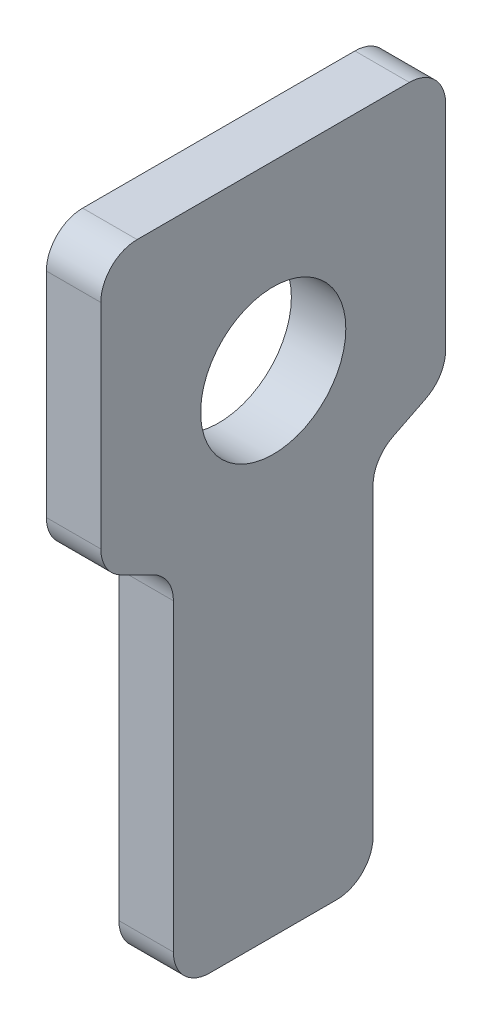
ISO-10303-21;
HEADER;
FILE_DESCRIPTION(('STEP AP214'),'2;1');
FILE_NAME('part.step','',(''),(''),'','','');
FILE_SCHEMA(('AUTOMOTIVE_DESIGN { 1 0 10303 214 1 1 1 1 }'));
ENDSEC;
DATA;
#1=APPLICATION_CONTEXT('core data for automotive mechanical design processes');
#2=APPLICATION_PROTOCOL_DEFINITION('international standard','automotive_design',2000,#1);
#3=PRODUCT_CONTEXT('',#1,'mechanical');
#4=PRODUCT('Part','Part','',(#3));
#5=PRODUCT_RELATED_PRODUCT_CATEGORY('part','',(#4));
#6=PRODUCT_DEFINITION_FORMATION('','',#4);
#7=PRODUCT_DEFINITION_CONTEXT('part definition',#1,'design');
#8=PRODUCT_DEFINITION('design','',#6,#7);
#9=PRODUCT_DEFINITION_SHAPE('','',#8);
#10=(LENGTH_UNIT() NAMED_UNIT(*) SI_UNIT(.MILLI.,.METRE.));
#11=(NAMED_UNIT(*) PLANE_ANGLE_UNIT() SI_UNIT($,.RADIAN.));
#12=(NAMED_UNIT(*) SI_UNIT($,.STERADIAN.) SOLID_ANGLE_UNIT());
#13=UNCERTAINTY_MEASURE_WITH_UNIT(LENGTH_MEASURE(1.E-05),#10,'distance_accuracy_value','');
#14=(GEOMETRIC_REPRESENTATION_CONTEXT(3) GLOBAL_UNCERTAINTY_ASSIGNED_CONTEXT((#13)) GLOBAL_UNIT_ASSIGNED_CONTEXT((#10,
#11,#12)) REPRESENTATION_CONTEXT('',''));
#15=CARTESIAN_POINT('',(0.,0.,0.));
#16=DIRECTION('',(0.,0.,1.));
#17=DIRECTION('',(1.,0.,0.));
#18=AXIS2_PLACEMENT_3D('',#15,#16,#17);
#19=CARTESIAN_POINT('',(3.,10.,-9.5));
#20=DIRECTION('',(-1.,0.,0.));
#21=DIRECTION('',(0.,0.,1.));
#22=AXIS2_PLACEMENT_3D('',#19,#20,#21);
#23=PLANE('',#22);
#24=DIRECTION('',(0.,-1.,0.));
#25=VECTOR('',#24,1.);
#26=CARTESIAN_POINT('',(3.,10.,9.5));
#27=LINE('',#26,#25);
#28=CARTESIAN_POINT('',(3.,8.,9.5));
#29=VERTEX_POINT('',#28);
#30=CARTESIAN_POINT('',(3.,-3.76393202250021,9.5));
#31=VERTEX_POINT('',#30);
#32=EDGE_CURVE('E269',#29,#31,#27,.T.);
#33=ORIENTED_EDGE('',*,*,#32,.T.);
#34=CARTESIAN_POINT('',(3.,-3.76393202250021,7.5));
#35=DIRECTION('',(-1.,0.,0.));
#36=DIRECTION('',(0.,0.,1.));
#37=AXIS2_PLACEMENT_3D('',#34,#35,#36);
#38=CIRCLE('',#37,2.);
#39=CARTESIAN_POINT('',(3.,-5.55278640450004,8.39442719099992));
#40=VERTEX_POINT('',#39);
#41=EDGE_CURVE('E222',#31,#40,#38,.F.);
#42=ORIENTED_EDGE('',*,*,#41,.T.);
#43=DIRECTION('',(0.,-0.447213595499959,-0.894427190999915));
#44=VECTOR('',#43,1.);
#45=CARTESIAN_POINT('',(3.,-5.,9.5));
#46=LINE('',#45,#44);
#47=CARTESIAN_POINT('',(3.,-6.44721359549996,6.60557280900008));
#48=VERTEX_POINT('',#47);
#49=EDGE_CURVE('E260',#40,#48,#46,.T.);
#50=ORIENTED_EDGE('',*,*,#49,.T.);
#51=CARTESIAN_POINT('',(3.,-8.2360679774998,7.5));
#52=DIRECTION('',(-1.,0.,0.));
#53=DIRECTION('',(0.,0.,1.));
#54=AXIS2_PLACEMENT_3D('',#51,#52,#53);
#55=CIRCLE('',#54,2.);
#56=CARTESIAN_POINT('',(3.,-8.2360679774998,5.5));
#57=VERTEX_POINT('',#56);
#58=EDGE_CURVE('E11',#48,#57,#55,.T.);
#59=ORIENTED_EDGE('',*,*,#58,.T.);
#60=DIRECTION('',(0.,-1.,0.));
#61=VECTOR('',#60,1.);
#62=CARTESIAN_POINT('',(3.,-7.00000000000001,5.5));
#63=LINE('',#62,#61);
#64=CARTESIAN_POINT('',(3.,-25.,5.49999999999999));
#65=VERTEX_POINT('',#64);
#66=EDGE_CURVE('E258',#57,#65,#63,.T.);
#67=ORIENTED_EDGE('',*,*,#66,.T.);
#68=CARTESIAN_POINT('',(3.,-25.,3.49999999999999));
#69=DIRECTION('',(-1.,0.,0.));
#70=DIRECTION('',(0.,0.,1.));
#71=AXIS2_PLACEMENT_3D('',#68,#69,#70);
#72=CIRCLE('',#71,2.);
#73=CARTESIAN_POINT('',(3.,-27.,3.49999999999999));
#74=VERTEX_POINT('',#73);
#75=EDGE_CURVE('E217',#65,#74,#72,.F.);
#76=ORIENTED_EDGE('',*,*,#75,.T.);
#77=DIRECTION('',(0.,0.,-1.));
#78=VECTOR('',#77,1.);
#79=CARTESIAN_POINT('',(3.,-27.,5.49999999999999));
#80=LINE('',#79,#78);
#81=CARTESIAN_POINT('',(3.,-27.,-3.50000000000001));
#82=VERTEX_POINT('',#81);
#83=EDGE_CURVE('E264',#74,#82,#80,.T.);
#84=ORIENTED_EDGE('',*,*,#83,.T.);
#85=CARTESIAN_POINT('',(3.,-25.,-3.50000000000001));
#86=DIRECTION('',(-1.,0.,0.));
#87=DIRECTION('',(0.,0.,1.));
#88=AXIS2_PLACEMENT_3D('',#85,#86,#87);
#89=CIRCLE('',#88,2.);
#90=CARTESIAN_POINT('',(3.,-25.,-5.50000000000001));
#91=VERTEX_POINT('',#90);
#92=EDGE_CURVE('E219',#82,#91,#89,.F.);
#93=ORIENTED_EDGE('',*,*,#92,.T.);
#94=DIRECTION('',(0.,1.,0.));
#95=VECTOR('',#94,1.);
#96=CARTESIAN_POINT('',(3.,-7.,-5.5));
#97=LINE('',#96,#95);
#98=CARTESIAN_POINT('',(3.,-8.23606797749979,-5.5));
#99=VERTEX_POINT('',#98);
#100=EDGE_CURVE('E267',#91,#99,#97,.T.);
#101=ORIENTED_EDGE('',*,*,#100,.T.);
#102=CARTESIAN_POINT('',(3.,-8.23606797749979,-7.5));
#103=DIRECTION('',(-1.,0.,0.));
#104=DIRECTION('',(0.,0.,1.));
#105=AXIS2_PLACEMENT_3D('',#102,#103,#104);
#106=CIRCLE('',#105,2.);
#107=CARTESIAN_POINT('',(3.,-6.44721359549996,-6.60557280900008));
#108=VERTEX_POINT('',#107);
#109=EDGE_CURVE('E155',#99,#108,#106,.T.);
#110=ORIENTED_EDGE('',*,*,#109,.T.);
#111=DIRECTION('',(0.,0.447213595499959,-0.894427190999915));
#112=VECTOR('',#111,1.);
#113=CARTESIAN_POINT('',(3.,-5.,-9.50000000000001));
#114=LINE('',#113,#112);
#115=CARTESIAN_POINT('',(3.,-5.55278640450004,-8.39442719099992));
#116=VERTEX_POINT('',#115);
#117=EDGE_CURVE('E164',#108,#116,#114,.T.);
#118=ORIENTED_EDGE('',*,*,#117,.T.);
#119=CARTESIAN_POINT('',(3.,-3.76393202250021,-7.50000000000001));
#120=DIRECTION('',(-1.,0.,0.));
#121=DIRECTION('',(0.,0.,1.));
#122=AXIS2_PLACEMENT_3D('',#119,#120,#121);
#123=CIRCLE('',#122,2.);
#124=CARTESIAN_POINT('',(3.,-3.76393202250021,-9.50000000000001));
#125=VERTEX_POINT('',#124);
#126=EDGE_CURVE('E53',#116,#125,#123,.F.);
#127=ORIENTED_EDGE('',*,*,#126,.T.);
#128=DIRECTION('',(0.,1.,0.));
#129=VECTOR('',#128,1.);
#130=CARTESIAN_POINT('',(3.,10.,-9.5));
#131=LINE('',#130,#129);
#132=CARTESIAN_POINT('',(3.,8.,-9.5));
#133=VERTEX_POINT('',#132);
#134=EDGE_CURVE('E182',#125,#133,#131,.T.);
#135=ORIENTED_EDGE('',*,*,#134,.T.);
#136=CARTESIAN_POINT('',(3.,8.,-7.5));
#137=DIRECTION('',(-1.,0.,0.));
#138=DIRECTION('',(0.,0.,1.));
#139=AXIS2_PLACEMENT_3D('',#136,#137,#138);
#140=CIRCLE('',#139,2.);
#141=CARTESIAN_POINT('',(3.,10.,-7.5));
#142=VERTEX_POINT('',#141);
#143=EDGE_CURVE('E215',#133,#142,#140,.F.);
#144=ORIENTED_EDGE('',*,*,#143,.T.);
#145=DIRECTION('',(0.,0.,1.));
#146=VECTOR('',#145,1.);
#147=CARTESIAN_POINT('',(3.,10.,9.5));
#148=LINE('',#147,#146);
#149=CARTESIAN_POINT('',(3.,10.,7.5));
#150=VERTEX_POINT('',#149);
#151=EDGE_CURVE('E176',#142,#150,#148,.T.);
#152=ORIENTED_EDGE('',*,*,#151,.T.);
#153=CARTESIAN_POINT('',(3.,8.,7.5));
#154=DIRECTION('',(-1.,0.,0.));
#155=DIRECTION('',(0.,0.,1.));
#156=AXIS2_PLACEMENT_3D('',#153,#154,#155);
#157=CIRCLE('',#156,2.);
#158=EDGE_CURVE('E213',#150,#29,#157,.F.);
#159=ORIENTED_EDGE('',*,*,#158,.T.);
#160=EDGE_LOOP('',(#33,#42,#50,#59,#67,#76,#84,#93,#101,#110,#118,#127,#135,#144,#152,#159));
#161=FACE_BOUND('',#160,.T.);
#162=CARTESIAN_POINT('',(3.,0.,0.));
#163=DIRECTION('',(1.,0.,0.));
#164=DIRECTION('',(0.,0.,-1.));
#165=AXIS2_PLACEMENT_3D('',#162,#163,#164);
#166=CIRCLE('',#165,4.);
#167=CARTESIAN_POINT('',(3.,0.,-4.));
#168=VERTEX_POINT('',#167);
#169=EDGE_CURVE('E280',#168,#168,#166,.T.);
#170=ORIENTED_EDGE('',*,*,#169,.F.);
#171=EDGE_LOOP('',(#170));
#172=FACE_BOUND('',#171,.T.);
#173=ADVANCED_FACE('F31',(#161,#172),#23,.F.);
#174=CARTESIAN_POINT('',(0.,10.,-9.5));
#175=DIRECTION('',(-1.,0.,0.));
#176=DIRECTION('',(0.,0.,1.));
#177=AXIS2_PLACEMENT_3D('',#174,#175,#176);
#178=PLANE('',#177);
#179=DIRECTION('',(0.,-0.447213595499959,-0.894427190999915));
#180=VECTOR('',#179,1.);
#181=CARTESIAN_POINT('',(0.,-5.,9.5));
#182=LINE('',#181,#180);
#183=CARTESIAN_POINT('',(0.,-5.55278640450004,8.39442719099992));
#184=VERTEX_POINT('',#183);
#185=CARTESIAN_POINT('',(0.,-6.44721359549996,6.60557280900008));
#186=VERTEX_POINT('',#185);
#187=EDGE_CURVE('E239',#184,#186,#182,.T.);
#188=ORIENTED_EDGE('',*,*,#187,.F.);
#189=CARTESIAN_POINT('',(0.,-3.76393202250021,7.5));
#190=DIRECTION('',(-1.,0.,0.));
#191=DIRECTION('',(0.,0.,1.));
#192=AXIS2_PLACEMENT_3D('',#189,#190,#191);
#193=CIRCLE('',#192,2.);
#194=CARTESIAN_POINT('',(0.,-3.76393202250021,9.5));
#195=VERTEX_POINT('',#194);
#196=EDGE_CURVE('E206',#184,#195,#193,.T.);
#197=ORIENTED_EDGE('',*,*,#196,.T.);
#198=DIRECTION('',(0.,-1.,0.));
#199=VECTOR('',#198,1.);
#200=CARTESIAN_POINT('',(0.,10.,9.5));
#201=LINE('',#200,#199);
#202=CARTESIAN_POINT('',(0.,8.,9.5));
#203=VERTEX_POINT('',#202);
#204=EDGE_CURVE('E250',#203,#195,#201,.T.);
#205=ORIENTED_EDGE('',*,*,#204,.F.);
#206=CARTESIAN_POINT('',(0.,8.,7.5));
#207=DIRECTION('',(-1.,0.,0.));
#208=DIRECTION('',(0.,0.,1.));
#209=AXIS2_PLACEMENT_3D('',#206,#207,#208);
#210=CIRCLE('',#209,2.);
#211=CARTESIAN_POINT('',(0.,10.,7.5));
#212=VERTEX_POINT('',#211);
#213=EDGE_CURVE('E197',#203,#212,#210,.T.);
#214=ORIENTED_EDGE('',*,*,#213,.T.);
#215=DIRECTION('',(0.,0.,1.));
#216=VECTOR('',#215,1.);
#217=CARTESIAN_POINT('',(0.,10.,9.5));
#218=LINE('',#217,#216);
#219=CARTESIAN_POINT('',(0.,10.,-7.5));
#220=VERTEX_POINT('',#219);
#221=EDGE_CURVE('E277',#220,#212,#218,.T.);
#222=ORIENTED_EDGE('',*,*,#221,.F.);
#223=CARTESIAN_POINT('',(0.,8.,-7.5));
#224=DIRECTION('',(-1.,0.,0.));
#225=DIRECTION('',(0.,0.,1.));
#226=AXIS2_PLACEMENT_3D('',#223,#224,#225);
#227=CIRCLE('',#226,2.);
#228=CARTESIAN_POINT('',(0.,8.,-9.5));
#229=VERTEX_POINT('',#228);
#230=EDGE_CURVE('E199',#220,#229,#227,.T.);
#231=ORIENTED_EDGE('',*,*,#230,.T.);
#232=DIRECTION('',(0.,1.,0.));
#233=VECTOR('',#232,1.);
#234=CARTESIAN_POINT('',(0.,10.,-9.5));
#235=LINE('',#234,#233);
#236=CARTESIAN_POINT('',(0.,-3.76393202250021,-9.50000000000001));
#237=VERTEX_POINT('',#236);
#238=EDGE_CURVE('E173',#237,#229,#235,.T.);
#239=ORIENTED_EDGE('',*,*,#238,.F.);
#240=CARTESIAN_POINT('',(0.,-3.76393202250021,-7.50000000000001));
#241=DIRECTION('',(-1.,0.,0.));
#242=DIRECTION('',(0.,0.,1.));
#243=AXIS2_PLACEMENT_3D('',#240,#241,#242);
#244=CIRCLE('',#243,2.);
#245=CARTESIAN_POINT('',(0.,-5.55278640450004,-8.39442719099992));
#246=VERTEX_POINT('',#245);
#247=EDGE_CURVE('E172',#237,#246,#244,.T.);
#248=ORIENTED_EDGE('',*,*,#247,.T.);
#249=DIRECTION('',(0.,0.447213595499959,-0.894427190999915));
#250=VECTOR('',#249,1.);
#251=CARTESIAN_POINT('',(0.,-5.,-9.50000000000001));
#252=LINE('',#251,#250);
#253=CARTESIAN_POINT('',(0.,-6.44721359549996,-6.60557280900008));
#254=VERTEX_POINT('',#253);
#255=EDGE_CURVE('E162',#254,#246,#252,.T.);
#256=ORIENTED_EDGE('',*,*,#255,.F.);
#257=CARTESIAN_POINT('',(0.,-8.23606797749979,-7.5));
#258=DIRECTION('',(-1.,0.,0.));
#259=DIRECTION('',(0.,0.,1.));
#260=AXIS2_PLACEMENT_3D('',#257,#258,#259);
#261=CIRCLE('',#260,2.);
#262=CARTESIAN_POINT('',(0.,-8.23606797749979,-5.5));
#263=VERTEX_POINT('',#262);
#264=EDGE_CURVE('E145',#254,#263,#261,.F.);
#265=ORIENTED_EDGE('',*,*,#264,.T.);
#266=DIRECTION('',(0.,1.,0.));
#267=VECTOR('',#266,1.);
#268=CARTESIAN_POINT('',(0.,-7.,-5.5));
#269=LINE('',#268,#267);
#270=CARTESIAN_POINT('',(0.,-25.,-5.50000000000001));
#271=VERTEX_POINT('',#270);
#272=EDGE_CURVE('E174',#271,#263,#269,.T.);
#273=ORIENTED_EDGE('',*,*,#272,.F.);
#274=CARTESIAN_POINT('',(0.,-25.,-3.50000000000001));
#275=DIRECTION('',(-1.,0.,0.));
#276=DIRECTION('',(0.,0.,1.));
#277=AXIS2_PLACEMENT_3D('',#274,#275,#276);
#278=CIRCLE('',#277,2.);
#279=CARTESIAN_POINT('',(0.,-27.,-3.50000000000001));
#280=VERTEX_POINT('',#279);
#281=EDGE_CURVE('E203',#271,#280,#278,.T.);
#282=ORIENTED_EDGE('',*,*,#281,.T.);
#283=DIRECTION('',(0.,0.,-1.));
#284=VECTOR('',#283,1.);
#285=CARTESIAN_POINT('',(0.,-27.,5.49999999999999));
#286=LINE('',#285,#284);
#287=CARTESIAN_POINT('',(0.,-27.,3.49999999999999));
#288=VERTEX_POINT('',#287);
#289=EDGE_CURVE('E178',#288,#280,#286,.T.);
#290=ORIENTED_EDGE('',*,*,#289,.F.);
#291=CARTESIAN_POINT('',(0.,-25.,3.49999999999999));
#292=DIRECTION('',(-1.,0.,0.));
#293=DIRECTION('',(0.,0.,1.));
#294=AXIS2_PLACEMENT_3D('',#291,#292,#293);
#295=CIRCLE('',#294,2.);
#296=CARTESIAN_POINT('',(0.,-25.,5.49999999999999));
#297=VERTEX_POINT('',#296);
#298=EDGE_CURVE('E201',#288,#297,#295,.T.);
#299=ORIENTED_EDGE('',*,*,#298,.T.);
#300=DIRECTION('',(0.,-1.,0.));
#301=VECTOR('',#300,1.);
#302=CARTESIAN_POINT('',(0.,-7.00000000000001,5.5));
#303=LINE('',#302,#301);
#304=CARTESIAN_POINT('',(0.,-8.2360679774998,5.5));
#305=VERTEX_POINT('',#304);
#306=EDGE_CURVE('E241',#305,#297,#303,.T.);
#307=ORIENTED_EDGE('',*,*,#306,.F.);
#308=CARTESIAN_POINT('',(0.,-8.2360679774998,7.5));
#309=DIRECTION('',(-1.,0.,0.));
#310=DIRECTION('',(0.,0.,1.));
#311=AXIS2_PLACEMENT_3D('',#308,#309,#310);
#312=CIRCLE('',#311,2.);
#313=EDGE_CURVE('E39',#305,#186,#312,.F.);
#314=ORIENTED_EDGE('',*,*,#313,.T.);
#315=EDGE_LOOP('',(#188,#197,#205,#214,#222,#231,#239,#248,#256,#265,#273,#282,#290,#299,#307,#314));
#316=FACE_BOUND('',#315,.T.);
#317=CARTESIAN_POINT('',(0.,0.,0.));
#318=DIRECTION('',(1.,0.,0.));
#319=DIRECTION('',(0.,0.,-1.));
#320=AXIS2_PLACEMENT_3D('',#317,#318,#319);
#321=CIRCLE('',#320,4.);
#322=CARTESIAN_POINT('',(0.,0.,-4.));
#323=VERTEX_POINT('',#322);
#324=EDGE_CURVE('E356',#323,#323,#321,.T.);
#325=ORIENTED_EDGE('',*,*,#324,.T.);
#326=EDGE_LOOP('',(#325));
#327=FACE_BOUND('',#326,.T.);
#328=ADVANCED_FACE('F169',(#316,#327),#178,.T.);
#329=CARTESIAN_POINT('',(3.,10.,9.5));
#330=DIRECTION('',(0.,-1.,0.));
#331=DIRECTION('',(0.,0.,-1.));
#332=AXIS2_PLACEMENT_3D('',#329,#330,#331);
#333=PLANE('',#332);
#334=ORIENTED_EDGE('',*,*,#151,.F.);
#335=DIRECTION('',(-1.,0.,0.));
#336=VECTOR('',#335,1.);
#337=CARTESIAN_POINT('',(3.,10.,-7.5));
#338=LINE('',#337,#336);
#339=EDGE_CURVE('E156',#142,#220,#338,.T.);
#340=ORIENTED_EDGE('',*,*,#339,.T.);
#341=ORIENTED_EDGE('',*,*,#221,.T.);
#342=DIRECTION('',(-1.,0.,0.));
#343=VECTOR('',#342,1.);
#344=CARTESIAN_POINT('',(3.,10.,7.5));
#345=LINE('',#344,#343);
#346=EDGE_CURVE('E233',#212,#150,#345,.F.);
#347=ORIENTED_EDGE('',*,*,#346,.T.);
#348=EDGE_LOOP('',(#334,#340,#341,#347));
#349=FACE_BOUND('',#348,.T.);
#350=ADVANCED_FACE('F311',(#349),#333,.F.);
#351=CARTESIAN_POINT('',(3.,10.,9.5));
#352=DIRECTION('',(0.,0.,-1.));
#353=DIRECTION('',(-1.,0.,0.));
#354=AXIS2_PLACEMENT_3D('',#351,#352,#353);
#355=PLANE('',#354);
#356=ORIENTED_EDGE('',*,*,#204,.T.);
#357=DIRECTION('',(-1.,0.,0.));
#358=VECTOR('',#357,1.);
#359=CARTESIAN_POINT('',(3.,-3.76393202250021,9.5));
#360=LINE('',#359,#358);
#361=EDGE_CURVE('E211',#195,#31,#360,.F.);
#362=ORIENTED_EDGE('',*,*,#361,.T.);
#363=ORIENTED_EDGE('',*,*,#32,.F.);
#364=DIRECTION('',(-1.,0.,0.));
#365=VECTOR('',#364,1.);
#366=CARTESIAN_POINT('',(3.,8.,9.5));
#367=LINE('',#366,#365);
#368=EDGE_CURVE('E208',#29,#203,#367,.T.);
#369=ORIENTED_EDGE('',*,*,#368,.T.);
#370=EDGE_LOOP('',(#356,#362,#363,#369));
#371=FACE_BOUND('',#370,.T.);
#372=ADVANCED_FACE('F369',(#371),#355,.F.);
#373=CARTESIAN_POINT('',(3.,-5.,9.5));
#374=DIRECTION('',(0.,0.894427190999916,-0.447213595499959));
#375=DIRECTION('',(0.,0.447213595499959,0.894427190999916));
#376=AXIS2_PLACEMENT_3D('',#373,#374,#375);
#377=PLANE('',#376);
#378=ORIENTED_EDGE('',*,*,#187,.T.);
#379=DIRECTION('',(-1.,0.,0.));
#380=VECTOR('',#379,1.);
#381=CARTESIAN_POINT('',(3.,-6.44721359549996,6.60557280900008));
#382=LINE('',#381,#380);
#383=EDGE_CURVE('E195',#186,#48,#382,.F.);
#384=ORIENTED_EDGE('',*,*,#383,.T.);
#385=ORIENTED_EDGE('',*,*,#49,.F.);
#386=DIRECTION('',(-1.,0.,0.));
#387=VECTOR('',#386,1.);
#388=CARTESIAN_POINT('',(3.,-5.55278640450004,8.39442719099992));
#389=LINE('',#388,#387);
#390=EDGE_CURVE('E192',#40,#184,#389,.T.);
#391=ORIENTED_EDGE('',*,*,#390,.T.);
#392=EDGE_LOOP('',(#378,#384,#385,#391));
#393=FACE_BOUND('',#392,.T.);
#394=ADVANCED_FACE('F246',(#393),#377,.F.);
#395=CARTESIAN_POINT('',(3.,-7.00000000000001,5.5));
#396=DIRECTION('',(0.,0.,-1.));
#397=DIRECTION('',(0.,1.,0.));
#398=AXIS2_PLACEMENT_3D('',#395,#396,#397);
#399=PLANE('',#398);
#400=ORIENTED_EDGE('',*,*,#66,.F.);
#401=DIRECTION('',(-1.,0.,0.));
#402=VECTOR('',#401,1.);
#403=CARTESIAN_POINT('',(0.,-8.2360679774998,5.5));
#404=LINE('',#403,#402);
#405=EDGE_CURVE('E189',#57,#305,#404,.T.);
#406=ORIENTED_EDGE('',*,*,#405,.T.);
#407=ORIENTED_EDGE('',*,*,#306,.T.);
#408=DIRECTION('',(-1.,0.,0.));
#409=VECTOR('',#408,1.);
#410=CARTESIAN_POINT('',(3.,-25.,5.49999999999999));
#411=LINE('',#410,#409);
#412=EDGE_CURVE('E187',#297,#65,#411,.F.);
#413=ORIENTED_EDGE('',*,*,#412,.T.);
#414=EDGE_LOOP('',(#400,#406,#407,#413));
#415=FACE_BOUND('',#414,.T.);
#416=ADVANCED_FACE('F262',(#415),#399,.F.);
#417=CARTESIAN_POINT('',(3.,-27.,5.49999999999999));
#418=DIRECTION('',(0.,1.,0.));
#419=DIRECTION('',(0.,0.,1.));
#420=AXIS2_PLACEMENT_3D('',#417,#418,#419);
#421=PLANE('',#420);
#422=ORIENTED_EDGE('',*,*,#289,.T.);
#423=DIRECTION('',(-1.,0.,0.));
#424=VECTOR('',#423,1.);
#425=CARTESIAN_POINT('',(3.,-27.,-3.50000000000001));
#426=LINE('',#425,#424);
#427=EDGE_CURVE('E231',#280,#82,#426,.F.);
#428=ORIENTED_EDGE('',*,*,#427,.T.);
#429=ORIENTED_EDGE('',*,*,#83,.F.);
#430=DIRECTION('',(-1.,0.,0.));
#431=VECTOR('',#430,1.);
#432=CARTESIAN_POINT('',(3.,-27.,3.49999999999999));
#433=LINE('',#432,#431);
#434=EDGE_CURVE('E228',#74,#288,#433,.T.);
#435=ORIENTED_EDGE('',*,*,#434,.T.);
#436=EDGE_LOOP('',(#422,#428,#429,#435));
#437=FACE_BOUND('',#436,.T.);
#438=ADVANCED_FACE('F287',(#437),#421,.F.);
#439=CARTESIAN_POINT('',(3.,-7.,-5.5));
#440=DIRECTION('',(0.,0.,1.));
#441=DIRECTION('',(0.,-1.,0.));
#442=AXIS2_PLACEMENT_3D('',#439,#440,#441);
#443=PLANE('',#442);
#444=ORIENTED_EDGE('',*,*,#272,.T.);
#445=DIRECTION('',(-1.,0.,0.));
#446=VECTOR('',#445,1.);
#447=CARTESIAN_POINT('',(3.,-8.23606797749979,-5.5));
#448=LINE('',#447,#446);
#449=EDGE_CURVE('E150',#263,#99,#448,.F.);
#450=ORIENTED_EDGE('',*,*,#449,.T.);
#451=ORIENTED_EDGE('',*,*,#100,.F.);
#452=DIRECTION('',(-1.,0.,0.));
#453=VECTOR('',#452,1.);
#454=CARTESIAN_POINT('',(3.,-25.,-5.50000000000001));
#455=LINE('',#454,#453);
#456=EDGE_CURVE('E165',#91,#271,#455,.T.);
#457=ORIENTED_EDGE('',*,*,#456,.T.);
#458=EDGE_LOOP('',(#444,#450,#451,#457));
#459=FACE_BOUND('',#458,.T.);
#460=ADVANCED_FACE('F296',(#459),#443,.F.);
#461=CARTESIAN_POINT('',(3.,-5.,-9.50000000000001));
#462=DIRECTION('',(0.,0.894427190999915,0.447213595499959));
#463=DIRECTION('',(0.,-0.447213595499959,0.894427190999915));
#464=AXIS2_PLACEMENT_3D('',#461,#462,#463);
#465=PLANE('',#464);
#466=ORIENTED_EDGE('',*,*,#117,.F.);
#467=DIRECTION('',(-1.,0.,0.));
#468=VECTOR('',#467,1.);
#469=CARTESIAN_POINT('',(0.,-6.44721359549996,-6.60557280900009));
#470=LINE('',#469,#468);
#471=EDGE_CURVE('E149',#108,#254,#470,.T.);
#472=ORIENTED_EDGE('',*,*,#471,.T.);
#473=ORIENTED_EDGE('',*,*,#255,.T.);
#474=DIRECTION('',(-1.,0.,0.));
#475=VECTOR('',#474,1.);
#476=CARTESIAN_POINT('',(3.,-5.55278640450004,-8.39442719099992));
#477=LINE('',#476,#475);
#478=EDGE_CURVE('E166',#246,#116,#477,.F.);
#479=ORIENTED_EDGE('',*,*,#478,.T.);
#480=EDGE_LOOP('',(#466,#472,#473,#479));
#481=FACE_BOUND('',#480,.T.);
#482=ADVANCED_FACE('F161',(#481),#465,.F.);
#483=CARTESIAN_POINT('',(3.,10.,-9.5));
#484=DIRECTION('',(0.,0.,1.));
#485=DIRECTION('',(0.,-1.,0.));
#486=AXIS2_PLACEMENT_3D('',#483,#484,#485);
#487=PLANE('',#486);
#488=ORIENTED_EDGE('',*,*,#134,.F.);
#489=DIRECTION('',(-1.,0.,0.));
#490=VECTOR('',#489,1.);
#491=CARTESIAN_POINT('',(3.,-3.76393202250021,-9.50000000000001));
#492=LINE('',#491,#490);
#493=EDGE_CURVE('E225',#125,#237,#492,.T.);
#494=ORIENTED_EDGE('',*,*,#493,.T.);
#495=ORIENTED_EDGE('',*,*,#238,.T.);
#496=DIRECTION('',(-1.,0.,0.));
#497=VECTOR('',#496,1.);
#498=CARTESIAN_POINT('',(3.,8.,-9.5));
#499=LINE('',#498,#497);
#500=EDGE_CURVE('E46',#229,#133,#499,.F.);
#501=ORIENTED_EDGE('',*,*,#500,.T.);
#502=EDGE_LOOP('',(#488,#494,#495,#501));
#503=FACE_BOUND('',#502,.T.);
#504=ADVANCED_FACE('F303',(#503),#487,.F.);
#505=CARTESIAN_POINT('',(3.,0.,0.));
#506=DIRECTION('',(-1.,0.,0.));
#507=DIRECTION('',(0.,0.,1.));
#508=AXIS2_PLACEMENT_3D('',#505,#506,#507);
#509=CYLINDRICAL_SURFACE('',#508,4.);
#510=ORIENTED_EDGE('',*,*,#169,.T.);
#511=EDGE_LOOP('',(#510));
#512=FACE_BOUND('',#511,.T.);
#513=ORIENTED_EDGE('',*,*,#324,.F.);
#514=EDGE_LOOP('',(#513));
#515=FACE_BOUND('',#514,.T.);
#516=ADVANCED_FACE('F314',(#512,#515),#509,.F.);
#517=CARTESIAN_POINT('',(3.,-8.23606797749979,-7.5));
#518=DIRECTION('',(1.,0.,0.));
#519=DIRECTION('',(0.,0.,-1.));
#520=AXIS2_PLACEMENT_3D('',#517,#518,#519);
#521=CYLINDRICAL_SURFACE('',#520,2.);
#522=ORIENTED_EDGE('',*,*,#109,.F.);
#523=ORIENTED_EDGE('',*,*,#449,.F.);
#524=ORIENTED_EDGE('',*,*,#264,.F.);
#525=ORIENTED_EDGE('',*,*,#471,.F.);
#526=EDGE_LOOP('',(#522,#523,#524,#525));
#527=FACE_BOUND('',#526,.T.);
#528=ADVANCED_FACE('F148',(#527),#521,.F.);
#529=CARTESIAN_POINT('',(3.,-8.2360679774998,7.5));
#530=DIRECTION('',(1.,0.,0.));
#531=DIRECTION('',(0.,0.,-1.));
#532=AXIS2_PLACEMENT_3D('',#529,#530,#531);
#533=CYLINDRICAL_SURFACE('',#532,2.);
#534=ORIENTED_EDGE('',*,*,#58,.F.);
#535=ORIENTED_EDGE('',*,*,#383,.F.);
#536=ORIENTED_EDGE('',*,*,#313,.F.);
#537=ORIENTED_EDGE('',*,*,#405,.F.);
#538=EDGE_LOOP('',(#534,#535,#536,#537));
#539=FACE_BOUND('',#538,.T.);
#540=ADVANCED_FACE('F253',(#539),#533,.F.);
#541=CARTESIAN_POINT('',(3.,-3.76393202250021,7.5));
#542=DIRECTION('',(-1.,0.,0.));
#543=DIRECTION('',(0.,0.,1.));
#544=AXIS2_PLACEMENT_3D('',#541,#542,#543);
#545=CYLINDRICAL_SURFACE('',#544,2.);
#546=ORIENTED_EDGE('',*,*,#41,.F.);
#547=ORIENTED_EDGE('',*,*,#361,.F.);
#548=ORIENTED_EDGE('',*,*,#196,.F.);
#549=ORIENTED_EDGE('',*,*,#390,.F.);
#550=EDGE_LOOP('',(#546,#547,#548,#549));
#551=FACE_BOUND('',#550,.T.);
#552=ADVANCED_FACE('F326',(#551),#545,.T.);
#553=CARTESIAN_POINT('',(3.,-3.76393202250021,-7.50000000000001));
#554=DIRECTION('',(-1.,0.,0.));
#555=DIRECTION('',(0.,0.,1.));
#556=AXIS2_PLACEMENT_3D('',#553,#554,#555);
#557=CYLINDRICAL_SURFACE('',#556,2.);
#558=ORIENTED_EDGE('',*,*,#126,.F.);
#559=ORIENTED_EDGE('',*,*,#478,.F.);
#560=ORIENTED_EDGE('',*,*,#247,.F.);
#561=ORIENTED_EDGE('',*,*,#493,.F.);
#562=EDGE_LOOP('',(#558,#559,#560,#561));
#563=FACE_BOUND('',#562,.T.);
#564=ADVANCED_FACE('F324',(#563),#557,.T.);
#565=CARTESIAN_POINT('',(3.,-25.,-3.50000000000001));
#566=DIRECTION('',(-1.,0.,0.));
#567=DIRECTION('',(0.,0.,1.));
#568=AXIS2_PLACEMENT_3D('',#565,#566,#567);
#569=CYLINDRICAL_SURFACE('',#568,2.);
#570=ORIENTED_EDGE('',*,*,#92,.F.);
#571=ORIENTED_EDGE('',*,*,#427,.F.);
#572=ORIENTED_EDGE('',*,*,#281,.F.);
#573=ORIENTED_EDGE('',*,*,#456,.F.);
#574=EDGE_LOOP('',(#570,#571,#572,#573));
#575=FACE_BOUND('',#574,.T.);
#576=ADVANCED_FACE('F292',(#575),#569,.T.);
#577=CARTESIAN_POINT('',(3.,-25.,3.49999999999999));
#578=DIRECTION('',(-1.,0.,0.));
#579=DIRECTION('',(0.,0.,1.));
#580=AXIS2_PLACEMENT_3D('',#577,#578,#579);
#581=CYLINDRICAL_SURFACE('',#580,2.);
#582=ORIENTED_EDGE('',*,*,#75,.F.);
#583=ORIENTED_EDGE('',*,*,#412,.F.);
#584=ORIENTED_EDGE('',*,*,#298,.F.);
#585=ORIENTED_EDGE('',*,*,#434,.F.);
#586=EDGE_LOOP('',(#582,#583,#584,#585));
#587=FACE_BOUND('',#586,.T.);
#588=ADVANCED_FACE('F332',(#587),#581,.T.);
#589=CARTESIAN_POINT('',(3.,8.,-7.5));
#590=DIRECTION('',(-1.,0.,0.));
#591=DIRECTION('',(0.,0.,1.));
#592=AXIS2_PLACEMENT_3D('',#589,#590,#591);
#593=CYLINDRICAL_SURFACE('',#592,2.);
#594=ORIENTED_EDGE('',*,*,#143,.F.);
#595=ORIENTED_EDGE('',*,*,#500,.F.);
#596=ORIENTED_EDGE('',*,*,#230,.F.);
#597=ORIENTED_EDGE('',*,*,#339,.F.);
#598=EDGE_LOOP('',(#594,#595,#596,#597));
#599=FACE_BOUND('',#598,.T.);
#600=ADVANCED_FACE('F339',(#599),#593,.T.);
#601=CARTESIAN_POINT('',(3.,8.,7.5));
#602=DIRECTION('',(-1.,0.,0.));
#603=DIRECTION('',(0.,0.,1.));
#604=AXIS2_PLACEMENT_3D('',#601,#602,#603);
#605=CYLINDRICAL_SURFACE('',#604,2.);
#606=ORIENTED_EDGE('',*,*,#158,.F.);
#607=ORIENTED_EDGE('',*,*,#346,.F.);
#608=ORIENTED_EDGE('',*,*,#213,.F.);
#609=ORIENTED_EDGE('',*,*,#368,.F.);
#610=EDGE_LOOP('',(#606,#607,#608,#609));
#611=FACE_BOUND('',#610,.T.);
#612=ADVANCED_FACE('F33',(#611),#605,.T.);
#613=CLOSED_SHELL('',(#173,#328,#350,#372,#394,#416,#438,#460,#482,#504,#516,#528,#540,#552,
#564,#576,#588,#600,#612));
#614=MANIFOLD_SOLID_BREP('B2',#613);
#615=ADVANCED_BREP_SHAPE_REPRESENTATION('',(#18,#614),#14);
#616=SHAPE_DEFINITION_REPRESENTATION(#9,#615);
ENDSEC;
END-ISO-10303-21;
